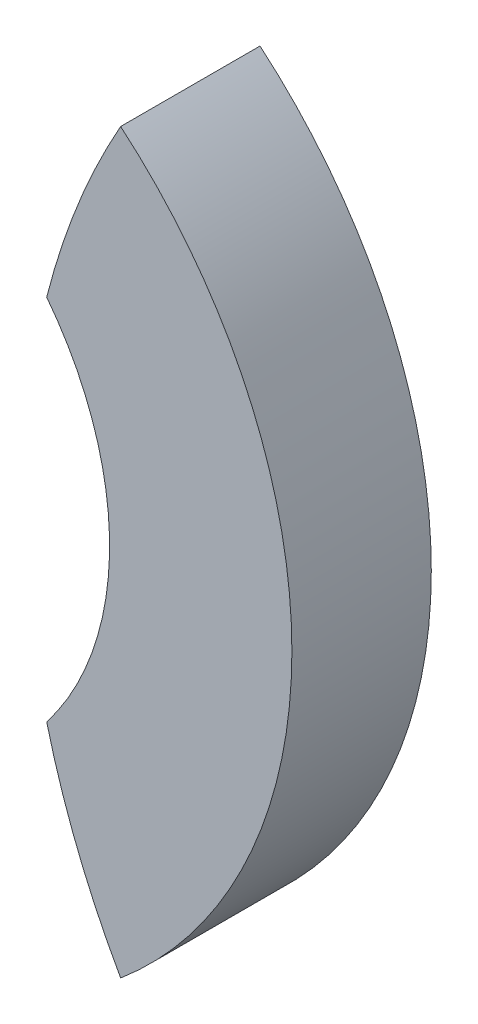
from build123d import *

# Parameters (mm, degrees)
BASE_EXTRUSION_DEPTH = 6.5


with BuildPart() as part:
    # Esquisse1 → Base-Extrusion (new body)
    with BuildSketch(Plane.XY):
        with BuildLine():
            ThreePointArc((14.513888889, -17.192935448), (22.5, 0), (14.513888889, 17.192935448))
            ThreePointArc((14.513888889, 17.192935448), (12.503325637, 12.998698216), (11.066666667, 8.574898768))
            ThreePointArc((11.066666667, 8.574898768), (14, 0), (11.066666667, -8.574898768))
            ThreePointArc((11.066666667, -8.574898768), (12.503325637, -12.998698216), (14.513888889, -17.192935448))
        make_face()
    extrude(amount=BASE_EXTRUSION_DEPTH)


solid = part.part
